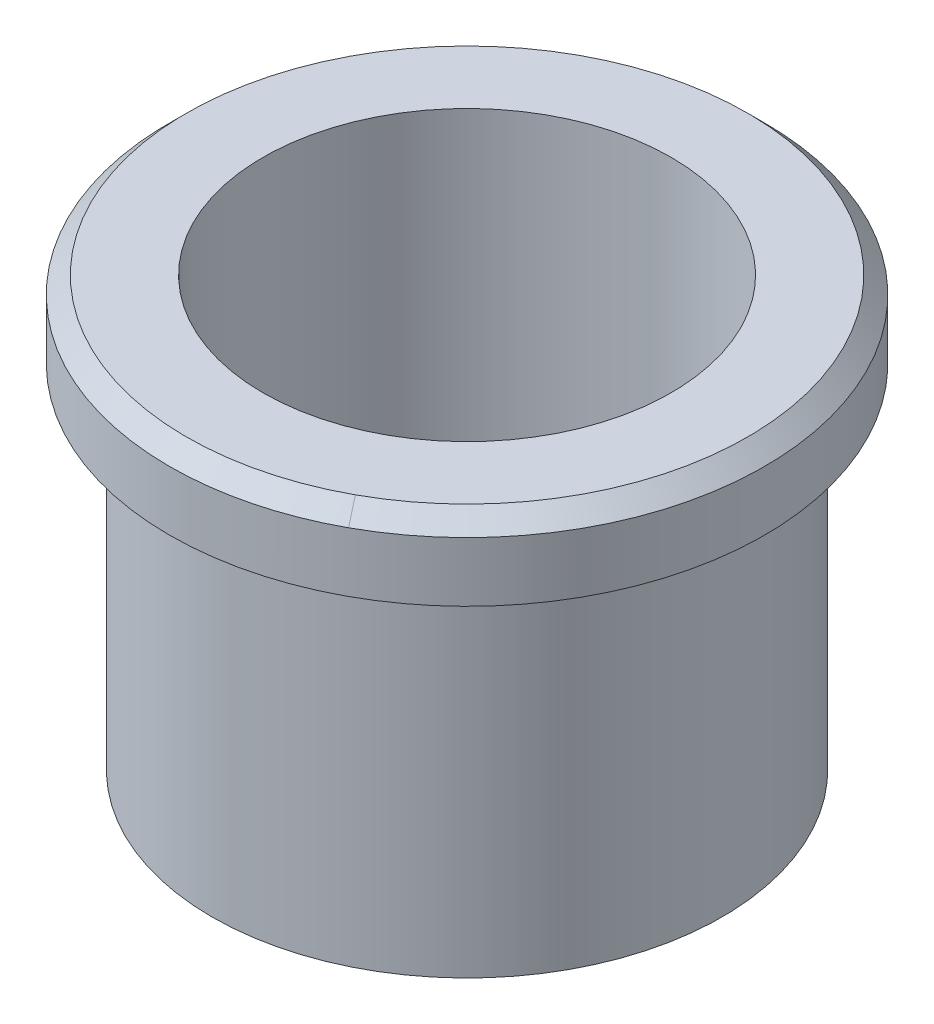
ISO-10303-21;
HEADER;
FILE_DESCRIPTION(('STEP AP214'),'2;1');
FILE_NAME('part.step','',(''),(''),'','','');
FILE_SCHEMA(('AUTOMOTIVE_DESIGN { 1 0 10303 214 1 1 1 1 }'));
ENDSEC;
DATA;
#1=APPLICATION_CONTEXT('core data for automotive mechanical design processes');
#2=APPLICATION_PROTOCOL_DEFINITION('international standard','automotive_design',2000,#1);
#3=PRODUCT_CONTEXT('',#1,'mechanical');
#4=PRODUCT('Part','Part','',(#3));
#5=PRODUCT_RELATED_PRODUCT_CATEGORY('part','',(#4));
#6=PRODUCT_DEFINITION_FORMATION('','',#4);
#7=PRODUCT_DEFINITION_CONTEXT('part definition',#1,'design');
#8=PRODUCT_DEFINITION('design','',#6,#7);
#9=PRODUCT_DEFINITION_SHAPE('','',#8);
#10=(LENGTH_UNIT() NAMED_UNIT(*) SI_UNIT(.MILLI.,.METRE.));
#11=(NAMED_UNIT(*) PLANE_ANGLE_UNIT() SI_UNIT($,.RADIAN.));
#12=(NAMED_UNIT(*) SI_UNIT($,.STERADIAN.) SOLID_ANGLE_UNIT());
#13=UNCERTAINTY_MEASURE_WITH_UNIT(LENGTH_MEASURE(1.E-05),#10,'distance_accuracy_value','');
#14=(GEOMETRIC_REPRESENTATION_CONTEXT(3) GLOBAL_UNCERTAINTY_ASSIGNED_CONTEXT((#13)) GLOBAL_UNIT_ASSIGNED_CONTEXT((#10,
#11,#12)) REPRESENTATION_CONTEXT('',''));
#15=CARTESIAN_POINT('',(0.,0.,0.));
#16=DIRECTION('',(0.,0.,1.));
#17=DIRECTION('',(1.,0.,0.));
#18=AXIS2_PLACEMENT_3D('',#15,#16,#17);
#19=CARTESIAN_POINT('',(0.,-12.75,0.));
#20=DIRECTION('',(0.,1.,0.));
#21=DIRECTION('',(0.,0.,1.));
#22=AXIS2_PLACEMENT_3D('',#19,#20,#21);
#23=CYLINDRICAL_SURFACE('',#22,12.);
#24=CARTESIAN_POINT('',(0.,0.,0.));
#25=DIRECTION('',(0.,1.,0.));
#26=DIRECTION('',(0.,0.,1.));
#27=AXIS2_PLACEMENT_3D('',#24,#25,#26);
#28=CIRCLE('',#27,12.);
#29=CARTESIAN_POINT('',(0.,0.,12.));
#30=VERTEX_POINT('',#29);
#31=EDGE_CURVE('E97',#30,#30,#28,.F.);
#32=ORIENTED_EDGE('',*,*,#31,.F.);
#33=EDGE_LOOP('',(#32));
#34=FACE_BOUND('',#33,.T.);
#35=CARTESIAN_POINT('',(0.,-25.2,0.));
#36=DIRECTION('',(0.,-1.,0.));
#37=DIRECTION('',(0.,0.,-1.));
#38=AXIS2_PLACEMENT_3D('',#35,#36,#37);
#39=CIRCLE('',#38,12.);
#40=CARTESIAN_POINT('',(0.,-25.2,-12.));
#41=VERTEX_POINT('',#40);
#42=EDGE_CURVE('E178',#41,#41,#39,.T.);
#43=ORIENTED_EDGE('',*,*,#42,.T.);
#44=EDGE_LOOP('',(#43));
#45=FACE_BOUND('',#44,.T.);
#46=ADVANCED_FACE('F30',(#34,#45),#23,.F.);
#47=CARTESIAN_POINT('',(0.,-12.75,0.));
#48=DIRECTION('',(0.,1.,0.));
#49=DIRECTION('',(0.,0.,1.));
#50=AXIS2_PLACEMENT_3D('',#47,#48,#49);
#51=CYLINDRICAL_SURFACE('',#50,15.);
#52=CARTESIAN_POINT('',(0.,-4.5,0.));
#53=DIRECTION('',(0.,1.,0.));
#54=DIRECTION('',(0.,0.,1.));
#55=AXIS2_PLACEMENT_3D('',#52,#53,#54);
#56=CIRCLE('',#55,15.);
#57=CARTESIAN_POINT('',(0.,-4.5,15.));
#58=VERTEX_POINT('',#57);
#59=EDGE_CURVE('E11',#58,#58,#56,.F.);
#60=ORIENTED_EDGE('',*,*,#59,.T.);
#61=EDGE_LOOP('',(#60));
#62=FACE_BOUND('',#61,.T.);
#63=CARTESIAN_POINT('',(0.,-25.2,0.));
#64=DIRECTION('',(0.,-1.,0.));
#65=DIRECTION('',(0.,0.,-1.));
#66=AXIS2_PLACEMENT_3D('',#63,#64,#65);
#67=CIRCLE('',#66,15.);
#68=CARTESIAN_POINT('',(0.,-25.2,-15.));
#69=VERTEX_POINT('',#68);
#70=EDGE_CURVE('E63',#69,#69,#67,.T.);
#71=ORIENTED_EDGE('',*,*,#70,.F.);
#72=EDGE_LOOP('',(#71));
#73=FACE_BOUND('',#72,.T.);
#74=ADVANCED_FACE('F32',(#62,#73),#51,.T.);
#75=CARTESIAN_POINT('',(0.,-0.999999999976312,0.));
#76=DIRECTION('',(0.,-1.,0.));
#77=DIRECTION('',(0.,0.,-1.));
#78=AXIS2_PLACEMENT_3D('',#75,#76,#77);
#79=CONICAL_SURFACE('',#78,17.4999999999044,0.785398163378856);
#80=DIRECTION('',(-0.339005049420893,0.707106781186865,-0.620544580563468));
#81=VECTOR('',#80,1.);
#82=CARTESIAN_POINT('',(239241.25428467,-499000.,437928.178495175));
#83=LINE('',#82,#81);
#84=CARTESIAN_POINT('',(7.91052138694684,0.,14.4801122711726));
#85=VERTEX_POINT('',#84);
#86=CARTESIAN_POINT('',(8.38994692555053,-0.999999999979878,15.3576948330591));
#87=VERTEX_POINT('',#86);
#88=EDGE_CURVE('E56',#85,#87,#83,.F.);
#89=ORIENTED_EDGE('',*,*,#88,.F.);
#90=CARTESIAN_POINT('',(0.,5.68572966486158E-11,0.));
#91=DIRECTION('',(0.,-1.,0.));
#92=DIRECTION('',(0.,0.,-1.));
#93=AXIS2_PLACEMENT_3D('',#90,#91,#92);
#94=CIRCLE('',#93,16.4999999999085);
#95=CARTESIAN_POINT('',(-7.91052085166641,2.84078316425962E-11,-14.4801125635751));
#96=VERTEX_POINT('',#95);
#97=EDGE_CURVE('E34',#96,#85,#94,.F.);
#98=ORIENTED_EDGE('',*,*,#97,.F.);
#99=CARTESIAN_POINT('',(-8.38994692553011,-1.00000000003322,-15.3576948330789));
#100=CARTESIAN_POINT('',(-8.36997083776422,-0.958333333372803,-15.3211289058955));
#101=CARTESIAN_POINT('',(-8.349994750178,-0.91666666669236,-15.2845629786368));
#102=CARTESIAN_POINT('',(-8.31004257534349,-0.833333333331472,-15.2114311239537));
#103=CARTESIAN_POINT('',(-8.2900664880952,-0.791666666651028,-15.1748651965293));
#104=CARTESIAN_POINT('',(-8.25011431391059,-0.70833333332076,-15.1017333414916));
#105=CARTESIAN_POINT('',(-8.23013822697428,-0.666666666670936,-15.0651674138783));
#106=CARTESIAN_POINT('',(-8.19018605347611,-0.583333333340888,-14.9920355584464));
#107=CARTESIAN_POINT('',(-8.17020996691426,-0.541666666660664,-14.9554696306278));
#108=CARTESIAN_POINT('',(-8.13025779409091,-0.458333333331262,-14.8823377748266));
#109=CARTESIAN_POINT('',(-8.11028170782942,-0.416666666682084,-14.8457718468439));
#110=CARTESIAN_POINT('',(-8.07032953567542,-0.333333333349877,-14.7726399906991));
#111=CARTESIAN_POINT('',(-8.05035344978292,-0.291666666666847,-14.736074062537));
#112=CARTESIAN_POINT('',(-8.0104012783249,-0.208333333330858,-14.6629422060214));
#113=CARTESIAN_POINT('',(-7.99042519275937,-0.166666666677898,-14.626376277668));
#114=CARTESIAN_POINT('',(-7.95047302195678,-0.083333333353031,-14.5532444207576));
#115=CARTESIAN_POINT('',(-7.93049693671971,-0.0416666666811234,-14.5166784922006));
#116=CARTESIAN_POINT('',(-7.91052085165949,0.,-14.4801125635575));
#117=B_SPLINE_CURVE_WITH_KNOTS('',3,(#99,#100,#101,#102,#103,#104,#105,#106,#107,#108,#109,#110,
#111,#112,#113,#114,#115,#116),.UNSPECIFIED.,.F.,.F.,(4,2,2,2,2,2,2,2,4),(0.,0.17677669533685,
0.353553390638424,0.53033008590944,0.707106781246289,0.883883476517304,1.06066017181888,
1.23743686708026,1.41421356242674),.UNSPECIFIED.);
#118=CARTESIAN_POINT('',(-8.38994692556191,-1.00000000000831,-15.3576948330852));
#119=VERTEX_POINT('',#118);
#120=EDGE_CURVE('E49',#119,#96,#117,.T.);
#121=ORIENTED_EDGE('',*,*,#120,.F.);
#122=CARTESIAN_POINT('',(0.,-1.,0.));
#123=DIRECTION('',(0.,1.,0.));
#124=DIRECTION('',(0.,0.,1.));
#125=AXIS2_PLACEMENT_3D('',#122,#123,#124);
#126=CIRCLE('',#125,17.5);
#127=EDGE_CURVE('E59',#87,#119,#126,.F.);
#128=ORIENTED_EDGE('',*,*,#127,.F.);
#129=EDGE_LOOP('',(#89,#98,#121,#128));
#130=FACE_BOUND('',#129,.T.);
#131=ADVANCED_FACE('F58',(#130),#79,.T.);
#132=CARTESIAN_POINT('',(0.,-1.00000000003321,0.));
#133=DIRECTION('',(0.,-1.,0.));
#134=DIRECTION('',(0.,0.,-1.));
#135=AXIS2_PLACEMENT_3D('',#132,#133,#134);
#136=CONICAL_SURFACE('',#135,17.4999999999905,0.785398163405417);
#137=ORIENTED_EDGE('',*,*,#120,.T.);
#138=CARTESIAN_POINT('',(0.,-5.65658631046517E-11,0.));
#139=DIRECTION('',(0.,-1.,0.));
#140=DIRECTION('',(0.,0.,-1.));
#141=AXIS2_PLACEMENT_3D('',#138,#139,#140);
#142=CIRCLE('',#141,16.4999999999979);
#143=EDGE_CURVE('E66',#85,#96,#142,.F.);
#144=ORIENTED_EDGE('',*,*,#143,.F.);
#145=ORIENTED_EDGE('',*,*,#88,.T.);
#146=CARTESIAN_POINT('',(0.,-1.,0.));
#147=DIRECTION('',(0.,1.,0.));
#148=DIRECTION('',(0.,0.,1.));
#149=AXIS2_PLACEMENT_3D('',#146,#147,#148);
#150=CIRCLE('',#149,17.5);
#151=EDGE_CURVE('E95',#119,#87,#150,.F.);
#152=ORIENTED_EDGE('',*,*,#151,.F.);
#153=EDGE_LOOP('',(#137,#144,#145,#152));
#154=FACE_BOUND('',#153,.T.);
#155=ADVANCED_FACE('F67',(#154),#136,.T.);
#156=CARTESIAN_POINT('',(0.,0.,12.));
#157=DIRECTION('',(0.,1.,0.));
#158=DIRECTION('',(0.,0.,1.));
#159=AXIS2_PLACEMENT_3D('',#156,#157,#158);
#160=PLANE('',#159);
#161=ORIENTED_EDGE('',*,*,#31,.T.);
#162=EDGE_LOOP('',(#161));
#163=FACE_BOUND('',#162,.T.);
#164=ORIENTED_EDGE('',*,*,#97,.T.);
#165=ORIENTED_EDGE('',*,*,#143,.T.);
#166=EDGE_LOOP('',(#164,#165));
#167=FACE_BOUND('',#166,.T.);
#168=ADVANCED_FACE('F69',(#163,#167),#160,.T.);
#169=CARTESIAN_POINT('',(0.,-12.75,0.));
#170=DIRECTION('',(0.,1.,0.));
#171=DIRECTION('',(0.,0.,1.));
#172=AXIS2_PLACEMENT_3D('',#169,#170,#171);
#173=CYLINDRICAL_SURFACE('',#172,17.5);
#174=CARTESIAN_POINT('',(0.,-4.5,0.));
#175=DIRECTION('',(0.,1.,0.));
#176=DIRECTION('',(0.,0.,1.));
#177=AXIS2_PLACEMENT_3D('',#174,#175,#176);
#178=CIRCLE('',#177,17.5);
#179=CARTESIAN_POINT('',(0.,-4.5,17.5));
#180=VERTEX_POINT('',#179);
#181=EDGE_CURVE('E40',#180,#180,#178,.T.);
#182=ORIENTED_EDGE('',*,*,#181,.T.);
#183=EDGE_LOOP('',(#182));
#184=FACE_BOUND('',#183,.T.);
#185=ORIENTED_EDGE('',*,*,#151,.T.);
#186=ORIENTED_EDGE('',*,*,#127,.T.);
#187=EDGE_LOOP('',(#185,#186));
#188=FACE_BOUND('',#187,.T.);
#189=ADVANCED_FACE('F108',(#184,#188),#173,.T.);
#190=CARTESIAN_POINT('',(0.,-4.5,17.5));
#191=DIRECTION('',(0.,1.,0.));
#192=DIRECTION('',(0.,0.,1.));
#193=AXIS2_PLACEMENT_3D('',#190,#191,#192);
#194=PLANE('',#193);
#195=ORIENTED_EDGE('',*,*,#59,.F.);
#196=EDGE_LOOP('',(#195));
#197=FACE_BOUND('',#196,.T.);
#198=ORIENTED_EDGE('',*,*,#181,.F.);
#199=EDGE_LOOP('',(#198));
#200=FACE_BOUND('',#199,.T.);
#201=ADVANCED_FACE('F110',(#197,#200),#194,.F.);
#202=CARTESIAN_POINT('',(0.,-25.2,0.));
#203=DIRECTION('',(0.,-1.,0.));
#204=DIRECTION('',(0.,0.,-1.));
#205=AXIS2_PLACEMENT_3D('',#202,#203,#204);
#206=PLANE('',#205);
#207=ORIENTED_EDGE('',*,*,#42,.F.);
#208=EDGE_LOOP('',(#207));
#209=FACE_BOUND('',#208,.T.);
#210=ORIENTED_EDGE('',*,*,#70,.T.);
#211=EDGE_LOOP('',(#210));
#212=FACE_BOUND('',#211,.T.);
#213=ADVANCED_FACE('F112',(#209,#212),#206,.T.);
#214=CLOSED_SHELL('',(#46,#74,#131,#155,#168,#189,#201,#213));
#215=MANIFOLD_SOLID_BREP('B2',#214);
#216=ADVANCED_BREP_SHAPE_REPRESENTATION('',(#18,#215),#14);
#217=SHAPE_DEFINITION_REPRESENTATION(#9,#216);
ENDSEC;
END-ISO-10303-21;
